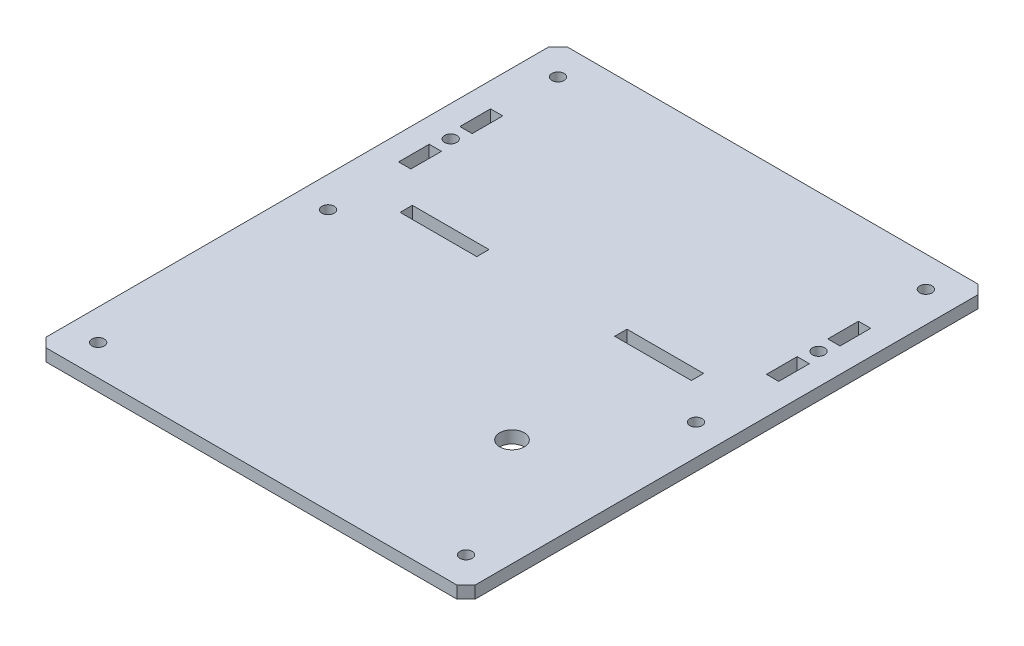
from build123d import *

# Parameters (mm, degrees)
BOSS_EXTRUDE1_DEPTH     = 4
CUT_EXTRUDE1_DEPTH      = 111.186206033
CUT_EXTRUDE1_DEPTH_BACK = 111.186206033
SKETCH3_R               = 4
SKETCH3_R_2             = 2
SKETCH3_W               = 25
SKETCH3_H               = 4
SKETCH3_W_2             = 4
SKETCH3_H_2             = 10


with BuildPart() as part:
    # Sketch2 → Boss-Extrude1 (new body)
    with BuildSketch(Plane(origin=(0, 0, 0), x_dir=(1, 0, 0), z_dir=(0, 1, 0))):
        Polygon((-70, 82), (-67, 85), (67, 85), (70, 82), (70, -82), (67, -85), (-67, -85), (-70, -82), align=None)
    extrude(amount=-BOSS_EXTRUDE1_DEPTH)

    # Sketch3 → Cut-Extrude1 (cut, two sides: drawn at the far end of the back side and taken through both)
    with BuildSketch(Plane(origin=(0, 0, 0), x_dir=(1, 0, 0), z_dir=(0, 1, 0)).offset(-CUT_EXTRUDE1_DEPTH_BACK)):
        with Locations(Location((35, -35, 0), (0, 0, 270))):
            Circle(SKETCH3_R)
        with Locations(Location((-60, 75, 0), (0, 0, 270))):
            Circle(SKETCH3_R_2)
        with Locations(Location((-60, 0, 0), (0, 0, 270))):
            Circle(SKETCH3_R_2)
        with Locations(Location((-60, -75, 0), (0, 0, 270))):
            Circle(SKETCH3_R_2)
        with Locations(Location((-60, 40, 0), (0, 0, 270))):
            Circle(SKETCH3_R_2)
        with Locations(Location((60, 40, 0), (0, 0, 90))):
            Circle(SKETCH3_R_2)
        with Locations(Location((60, -75, 0), (0, 0, 90))):
            Circle(SKETCH3_R_2)
        with Locations(Location((60, 0, 0), (0, 0, 90))):
            Circle(SKETCH3_R_2)
        with Locations(Location((60, 75, 0), (0, 0, 90))):
            Circle(SKETCH3_R_2)
        with Locations((-35, 13)):
            Rectangle(SKETCH3_W, SKETCH3_H)
        with Locations((-60, 30)):
            Rectangle(SKETCH3_W_2, SKETCH3_H_2)
        with Locations((-60, 50)):
            Rectangle(SKETCH3_W_2, SKETCH3_H_2)
        with Locations((60, 50)):
            Rectangle(SKETCH3_W_2, SKETCH3_H_2)
        with Locations((60, 30)):
            Rectangle(SKETCH3_W_2, SKETCH3_H_2)
        with Locations((35, 13)):
            Rectangle(SKETCH3_W, SKETCH3_H)
    extrude(amount=CUT_EXTRUDE1_DEPTH + CUT_EXTRUDE1_DEPTH_BACK, mode=Mode.SUBTRACT)


solid = part.part
